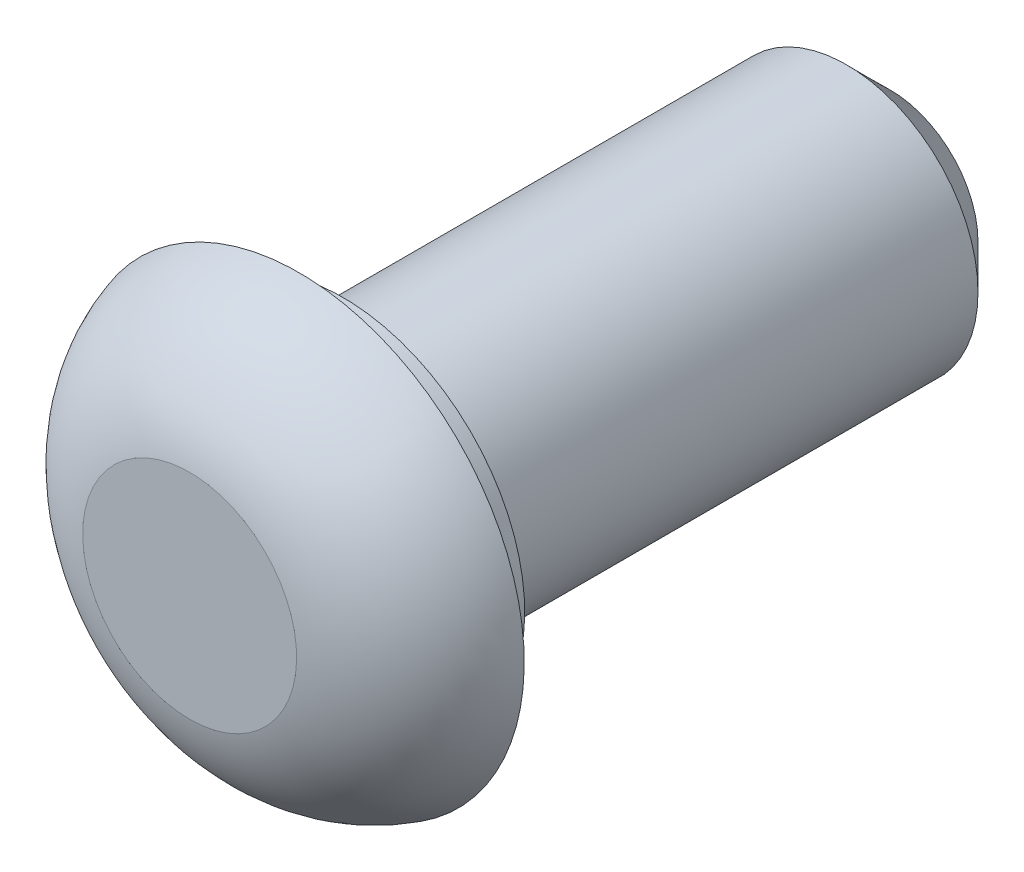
ISO-10303-21;
HEADER;
FILE_DESCRIPTION(('STEP AP214'),'2;1');
FILE_NAME('part.step','',(''),(''),'','','');
FILE_SCHEMA(('AUTOMOTIVE_DESIGN { 1 0 10303 214 1 1 1 1 }'));
ENDSEC;
DATA;
#1=APPLICATION_CONTEXT('core data for automotive mechanical design processes');
#2=APPLICATION_PROTOCOL_DEFINITION('international standard','automotive_design',2000,#1);
#3=PRODUCT_CONTEXT('',#1,'mechanical');
#4=PRODUCT('Part','Part','',(#3));
#5=PRODUCT_RELATED_PRODUCT_CATEGORY('part','',(#4));
#6=PRODUCT_DEFINITION_FORMATION('','',#4);
#7=PRODUCT_DEFINITION_CONTEXT('part definition',#1,'design');
#8=PRODUCT_DEFINITION('design','',#6,#7);
#9=PRODUCT_DEFINITION_SHAPE('','',#8);
#10=(LENGTH_UNIT() NAMED_UNIT(*) SI_UNIT(.MILLI.,.METRE.));
#11=(NAMED_UNIT(*) PLANE_ANGLE_UNIT() SI_UNIT($,.RADIAN.));
#12=(NAMED_UNIT(*) SI_UNIT($,.STERADIAN.) SOLID_ANGLE_UNIT());
#13=UNCERTAINTY_MEASURE_WITH_UNIT(LENGTH_MEASURE(1.E-05),#10,'distance_accuracy_value','');
#14=(GEOMETRIC_REPRESENTATION_CONTEXT(3) GLOBAL_UNCERTAINTY_ASSIGNED_CONTEXT((#13)) GLOBAL_UNIT_ASSIGNED_CONTEXT((#10,
#11,#12)) REPRESENTATION_CONTEXT('',''));
#15=CARTESIAN_POINT('',(0.,0.,0.));
#16=DIRECTION('',(0.,0.,1.));
#17=DIRECTION('',(1.,0.,0.));
#18=AXIS2_PLACEMENT_3D('',#15,#16,#17);
#19=CARTESIAN_POINT('',(0.,0.,10.));
#20=DIRECTION('',(0.,0.,1.));
#21=DIRECTION('',(0.,-1.,0.));
#22=AXIS2_PLACEMENT_3D('',#19,#20,#21);
#23=CYLINDRICAL_SURFACE('',#22,6.00000000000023);
#24=CARTESIAN_POINT('',(0.,0.,-25.));
#25=DIRECTION('',(0.,0.,1.));
#26=DIRECTION('',(1.,0.,0.));
#27=AXIS2_PLACEMENT_3D('',#24,#25,#26);
#28=CIRCLE('',#27,6.00000000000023);
#29=CARTESIAN_POINT('',(6.00000000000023,0.,-25.));
#30=VERTEX_POINT('',#29);
#31=EDGE_CURVE('E19',#30,#30,#28,.T.);
#32=ORIENTED_EDGE('',*,*,#31,.T.);
#33=EDGE_LOOP('',(#32));
#34=FACE_BOUND('',#33,.T.);
#35=CARTESIAN_POINT('',(0.,0.,-2.));
#36=DIRECTION('',(0.,0.,1.));
#37=DIRECTION('',(0.,-1.,0.));
#38=AXIS2_PLACEMENT_3D('',#35,#36,#37);
#39=CIRCLE('',#38,6.00000000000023);
#40=CARTESIAN_POINT('',(0.,-6.00000000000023,-2.));
#41=VERTEX_POINT('',#40);
#42=EDGE_CURVE('E23',#41,#41,#39,.T.);
#43=ORIENTED_EDGE('',*,*,#42,.F.);
#44=EDGE_LOOP('',(#43));
#45=FACE_BOUND('',#44,.T.);
#46=ADVANCED_FACE('F12',(#34,#45),#23,.T.);
#47=CARTESIAN_POINT('',(6.00000000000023,0.,-2.));
#48=DIRECTION('',(0.,0.,1.));
#49=DIRECTION('',(0.,-1.,0.));
#50=AXIS2_PLACEMENT_3D('',#47,#48,#49);
#51=PLANE('',#50);
#52=CARTESIAN_POINT('',(0.,0.,-2.));
#53=DIRECTION('',(0.,0.,1.));
#54=DIRECTION('',(0.,-1.,0.));
#55=AXIS2_PLACEMENT_3D('',#52,#53,#54);
#56=CIRCLE('',#55,8.30000049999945);
#57=CARTESIAN_POINT('',(0.,-8.30000049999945,-2.));
#58=VERTEX_POINT('',#57);
#59=EDGE_CURVE('E27',#58,#58,#56,.T.);
#60=ORIENTED_EDGE('',*,*,#59,.F.);
#61=EDGE_LOOP('',(#60));
#62=FACE_BOUND('',#61,.T.);
#63=ORIENTED_EDGE('',*,*,#42,.T.);
#64=EDGE_LOOP('',(#63));
#65=FACE_BOUND('',#64,.T.);
#66=ADVANCED_FACE('F59',(#62,#65),#51,.F.);
#67=CARTESIAN_POINT('',(0.,0.,10.));
#68=DIRECTION('',(0.,0.,1.));
#69=DIRECTION('',(0.,-1.,0.));
#70=AXIS2_PLACEMENT_3D('',#67,#68,#69);
#71=CYLINDRICAL_SURFACE('',#70,8.30000049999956);
#72=CARTESIAN_POINT('',(0.,0.,0.));
#73=DIRECTION('',(0.,0.,1.));
#74=DIRECTION('',(0.,-1.,0.));
#75=AXIS2_PLACEMENT_3D('',#72,#73,#74);
#76=CIRCLE('',#75,8.30000049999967);
#77=CARTESIAN_POINT('',(0.,-8.30000049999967,0.));
#78=VERTEX_POINT('',#77);
#79=EDGE_CURVE('E32',#78,#78,#76,.T.);
#80=ORIENTED_EDGE('',*,*,#79,.F.);
#81=EDGE_LOOP('',(#80));
#82=FACE_BOUND('',#81,.T.);
#83=ORIENTED_EDGE('',*,*,#59,.T.);
#84=EDGE_LOOP('',(#83));
#85=FACE_BOUND('',#84,.T.);
#86=ADVANCED_FACE('F53',(#82,#85),#71,.T.);
#87=CARTESIAN_POINT('',(8.30000049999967,0.,0.));
#88=DIRECTION('',(0.,0.,1.));
#89=DIRECTION('',(0.,-1.,0.));
#90=AXIS2_PLACEMENT_3D('',#87,#88,#89);
#91=PLANE('',#90);
#92=CARTESIAN_POINT('',(0.,0.,0.));
#93=DIRECTION('',(0.,0.,1.));
#94=DIRECTION('',(0.,-1.,0.));
#95=AXIS2_PLACEMENT_3D('',#92,#93,#94);
#96=CIRCLE('',#95,10.2780898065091);
#97=CARTESIAN_POINT('',(0.,-10.2780898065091,0.));
#98=VERTEX_POINT('',#97);
#99=EDGE_CURVE('E35',#98,#98,#96,.T.);
#100=ORIENTED_EDGE('',*,*,#99,.F.);
#101=EDGE_LOOP('',(#100));
#102=FACE_BOUND('',#101,.T.);
#103=ORIENTED_EDGE('',*,*,#79,.T.);
#104=EDGE_LOOP('',(#103));
#105=FACE_BOUND('',#104,.T.);
#106=ADVANCED_FACE('F47',(#102,#105),#91,.F.);
#107=CARTESIAN_POINT('',(0.,0.,-1.86804924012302));
#108=DIRECTION('',(0.,0.,1.));
#109=DIRECTION('',(0.,-1.,0.));
#110=AXIS2_PLACEMENT_3D('',#107,#108,#109);
#111=DEGENERATE_TOROIDAL_SURFACE('',#110,3.53195075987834,7.,.T.);
#112=CARTESIAN_POINT('',(0.,0.,4.99999999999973));
#113=DIRECTION('',(0.,0.,1.));
#114=DIRECTION('',(0.,-1.,0.));
#115=AXIS2_PLACEMENT_3D('',#112,#113,#114);
#116=CIRCLE('',#115,4.88468858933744);
#117=CARTESIAN_POINT('',(0.,-4.88468858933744,4.99999999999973));
#118=VERTEX_POINT('',#117);
#119=EDGE_CURVE('E38',#118,#118,#116,.T.);
#120=ORIENTED_EDGE('',*,*,#119,.F.);
#121=EDGE_LOOP('',(#120));
#122=FACE_BOUND('',#121,.T.);
#123=ORIENTED_EDGE('',*,*,#99,.T.);
#124=EDGE_LOOP('',(#123));
#125=FACE_BOUND('',#124,.T.);
#126=ADVANCED_FACE('F44',(#122,#125),#111,.T.);
#127=CARTESIAN_POINT('',(0.,0.,4.99999999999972));
#128=DIRECTION('',(0.,0.,-1.));
#129=DIRECTION('',(0.,1.,0.));
#130=AXIS2_PLACEMENT_3D('',#127,#128,#129);
#131=PLANE('',#130);
#132=ORIENTED_EDGE('',*,*,#119,.T.);
#133=EDGE_LOOP('',(#132));
#134=FACE_BOUND('',#133,.T.);
#135=ADVANCED_FACE('F42',(#134),#131,.F.);
#136=CARTESIAN_POINT('',(6.00000000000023,0.,-27.));
#137=DIRECTION('',(0.,0.,1.));
#138=DIRECTION('',(0.,-1.,0.));
#139=AXIS2_PLACEMENT_3D('',#136,#137,#138);
#140=PLANE('',#139);
#141=CARTESIAN_POINT('',(0.,0.,-27.));
#142=DIRECTION('',(0.,0.,1.));
#143=DIRECTION('',(1.,0.,0.));
#144=AXIS2_PLACEMENT_3D('',#141,#142,#143);
#145=CIRCLE('',#144,4.00000000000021);
#146=CARTESIAN_POINT('',(4.00000000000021,0.,-27.));
#147=VERTEX_POINT('',#146);
#148=EDGE_CURVE('E8',#147,#147,#145,.F.);
#149=ORIENTED_EDGE('',*,*,#148,.T.);
#150=EDGE_LOOP('',(#149));
#151=FACE_BOUND('',#150,.T.);
#152=ADVANCED_FACE('F76',(#151),#140,.F.);
#153=CARTESIAN_POINT('',(0.,0.,-25.));
#154=DIRECTION('',(0.,0.,1.));
#155=DIRECTION('',(1.,0.,0.));
#156=AXIS2_PLACEMENT_3D('',#153,#154,#155);
#157=CONICAL_SURFACE('',#156,6.00000000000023,0.78539816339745);
#158=ORIENTED_EDGE('',*,*,#148,.F.);
#159=EDGE_LOOP('',(#158));
#160=FACE_BOUND('',#159,.T.);
#161=ORIENTED_EDGE('',*,*,#31,.F.);
#162=EDGE_LOOP('',(#161));
#163=FACE_BOUND('',#162,.T.);
#164=ADVANCED_FACE('F14',(#160,#163),#157,.T.);
#165=CLOSED_SHELL('',(#46,#66,#86,#106,#126,#135,#152,#164));
#166=MANIFOLD_SOLID_BREP('B1',#165);
#167=ADVANCED_BREP_SHAPE_REPRESENTATION('',(#18,#166),#14);
#168=SHAPE_DEFINITION_REPRESENTATION(#9,#167);
ENDSEC;
END-ISO-10303-21;
